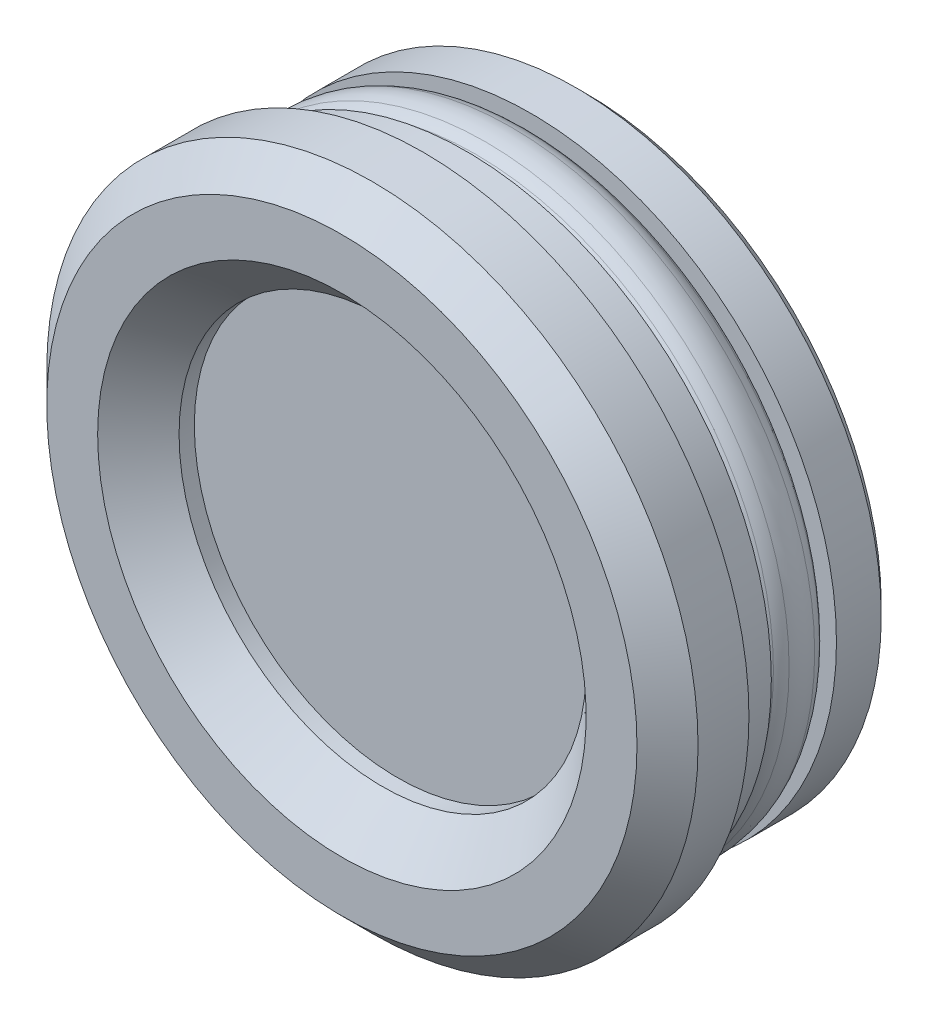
ISO-10303-21;
HEADER;
FILE_DESCRIPTION(('STEP AP214'),'2;1');
FILE_NAME('part.step','',(''),(''),'','','');
FILE_SCHEMA(('AUTOMOTIVE_DESIGN { 1 0 10303 214 1 1 1 1 }'));
ENDSEC;
DATA;
#1=APPLICATION_CONTEXT('core data for automotive mechanical design processes');
#2=APPLICATION_PROTOCOL_DEFINITION('international standard','automotive_design',2000,#1);
#3=PRODUCT_CONTEXT('',#1,'mechanical');
#4=PRODUCT('Part','Part','',(#3));
#5=PRODUCT_RELATED_PRODUCT_CATEGORY('part','',(#4));
#6=PRODUCT_DEFINITION_FORMATION('','',#4);
#7=PRODUCT_DEFINITION_CONTEXT('part definition',#1,'design');
#8=PRODUCT_DEFINITION('design','',#6,#7);
#9=PRODUCT_DEFINITION_SHAPE('','',#8);
#10=(LENGTH_UNIT() NAMED_UNIT(*) SI_UNIT(.MILLI.,.METRE.));
#11=(NAMED_UNIT(*) PLANE_ANGLE_UNIT() SI_UNIT($,.RADIAN.));
#12=(NAMED_UNIT(*) SI_UNIT($,.STERADIAN.) SOLID_ANGLE_UNIT());
#13=UNCERTAINTY_MEASURE_WITH_UNIT(LENGTH_MEASURE(1.E-05),#10,'distance_accuracy_value','');
#14=(GEOMETRIC_REPRESENTATION_CONTEXT(3) GLOBAL_UNCERTAINTY_ASSIGNED_CONTEXT((#13)) GLOBAL_UNIT_ASSIGNED_CONTEXT((#10,
#11,#12)) REPRESENTATION_CONTEXT('',''));
#15=CARTESIAN_POINT('',(0.,0.,0.));
#16=DIRECTION('',(0.,0.,1.));
#17=DIRECTION('',(1.,0.,0.));
#18=AXIS2_PLACEMENT_3D('',#15,#16,#17);
#19=CARTESIAN_POINT('',(0.,0.,-8.3));
#20=DIRECTION('',(0.,0.,-1.));
#21=DIRECTION('',(1.,0.,0.));
#22=AXIS2_PLACEMENT_3D('',#19,#20,#21);
#23=PLANE('',#22);
#24=CARTESIAN_POINT('',(0.,0.,-8.3));
#25=DIRECTION('',(0.,0.,-1.));
#26=DIRECTION('',(1.,0.,0.));
#27=AXIS2_PLACEMENT_3D('',#24,#25,#26);
#28=CIRCLE('',#27,13.5);
#29=CARTESIAN_POINT('',(13.5,0.,-8.3));
#30=VERTEX_POINT('',#29);
#31=EDGE_CURVE('E70',#30,#30,#28,.T.);
#32=ORIENTED_EDGE('',*,*,#31,.T.);
#33=EDGE_LOOP('',(#32));
#34=FACE_BOUND('',#33,.T.);
#35=ADVANCED_FACE('F12',(#34),#23,.T.);
#36=CARTESIAN_POINT('',(0.,0.,4.));
#37=DIRECTION('',(0.,0.,-1.));
#38=DIRECTION('',(1.,0.,0.));
#39=AXIS2_PLACEMENT_3D('',#36,#37,#38);
#40=PLANE('',#39);
#41=CARTESIAN_POINT('',(0.,0.,4.));
#42=DIRECTION('',(0.,0.,1.));
#43=DIRECTION('',(-1.,0.,0.));
#44=AXIS2_PLACEMENT_3D('',#41,#42,#43);
#45=CIRCLE('',#44,12.);
#46=CARTESIAN_POINT('',(-12.,0.,4.));
#47=VERTEX_POINT('',#46);
#48=EDGE_CURVE('E79',#47,#47,#45,.T.);
#49=ORIENTED_EDGE('',*,*,#48,.F.);
#50=EDGE_LOOP('',(#49));
#51=FACE_BOUND('',#50,.T.);
#52=CARTESIAN_POINT('',(0.,0.,4.));
#53=DIRECTION('',(0.,0.,-1.));
#54=DIRECTION('',(1.,0.,0.));
#55=AXIS2_PLACEMENT_3D('',#52,#53,#54);
#56=CIRCLE('',#55,14.5);
#57=CARTESIAN_POINT('',(14.5,0.,4.));
#58=VERTEX_POINT('',#57);
#59=EDGE_CURVE('E8',#58,#58,#56,.T.);
#60=ORIENTED_EDGE('',*,*,#59,.F.);
#61=EDGE_LOOP('',(#60));
#62=FACE_BOUND('',#61,.T.);
#63=ADVANCED_FACE('F85',(#51,#62),#40,.F.);
#64=CARTESIAN_POINT('',(0.,0.,4.));
#65=DIRECTION('',(0.,0.,-1.));
#66=DIRECTION('',(1.,0.,0.));
#67=AXIS2_PLACEMENT_3D('',#64,#65,#66);
#68=CONICAL_SURFACE('',#67,14.5,0.785398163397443);
#69=CARTESIAN_POINT('',(0.,0.,2.5));
#70=DIRECTION('',(0.,0.,-1.));
#71=DIRECTION('',(1.,0.,0.));
#72=AXIS2_PLACEMENT_3D('',#69,#70,#71);
#73=CIRCLE('',#72,16.);
#74=CARTESIAN_POINT('',(16.,0.,2.5));
#75=VERTEX_POINT('',#74);
#76=EDGE_CURVE('E18',#75,#75,#73,.T.);
#77=ORIENTED_EDGE('',*,*,#76,.F.);
#78=EDGE_LOOP('',(#77));
#79=FACE_BOUND('',#78,.T.);
#80=ORIENTED_EDGE('',*,*,#59,.T.);
#81=EDGE_LOOP('',(#80));
#82=FACE_BOUND('',#81,.T.);
#83=ADVANCED_FACE('F88',(#79,#82),#68,.T.);
#84=CARTESIAN_POINT('',(0.,0.,-14.0253012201));
#85=DIRECTION('',(0.,0.,-1.));
#86=DIRECTION('',(1.,0.,0.));
#87=AXIS2_PLACEMENT_3D('',#84,#85,#86);
#88=CYLINDRICAL_SURFACE('',#87,16.);
#89=CARTESIAN_POINT('',(0.,0.,0.));
#90=DIRECTION('',(0.,0.,-1.));
#91=DIRECTION('',(1.,0.,0.));
#92=AXIS2_PLACEMENT_3D('',#89,#90,#91);
#93=CIRCLE('',#92,16.);
#94=CARTESIAN_POINT('',(16.,0.,0.));
#95=VERTEX_POINT('',#94);
#96=EDGE_CURVE('E22',#95,#95,#93,.T.);
#97=ORIENTED_EDGE('',*,*,#96,.F.);
#98=EDGE_LOOP('',(#97));
#99=FACE_BOUND('',#98,.T.);
#100=ORIENTED_EDGE('',*,*,#76,.T.);
#101=EDGE_LOOP('',(#100));
#102=FACE_BOUND('',#101,.T.);
#103=ADVANCED_FACE('F95',(#99,#102),#88,.T.);
#104=CARTESIAN_POINT('',(0.,-15.,0.));
#105=DIRECTION('',(0.,0.,-1.));
#106=DIRECTION('',(1.,0.,0.));
#107=AXIS2_PLACEMENT_3D('',#104,#105,#106);
#108=PLANE('',#107);
#109=ORIENTED_EDGE('',*,*,#96,.T.);
#110=EDGE_LOOP('',(#109));
#111=FACE_BOUND('',#110,.T.);
#112=CARTESIAN_POINT('',(0.,0.,0.));
#113=DIRECTION('',(0.,0.,-1.));
#114=DIRECTION('',(1.,0.,0.));
#115=AXIS2_PLACEMENT_3D('',#112,#113,#114);
#116=CIRCLE('',#115,15.);
#117=CARTESIAN_POINT('',(15.,0.,0.));
#118=VERTEX_POINT('',#117);
#119=EDGE_CURVE('E26',#118,#118,#116,.T.);
#120=ORIENTED_EDGE('',*,*,#119,.F.);
#121=EDGE_LOOP('',(#120));
#122=FACE_BOUND('',#121,.T.);
#123=ADVANCED_FACE('F102',(#111,#122),#108,.T.);
#124=CARTESIAN_POINT('',(0.,0.,-14.0253012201));
#125=DIRECTION('',(0.,0.,-1.));
#126=DIRECTION('',(1.,0.,0.));
#127=AXIS2_PLACEMENT_3D('',#124,#125,#126);
#128=CYLINDRICAL_SURFACE('',#127,15.);
#129=ORIENTED_EDGE('',*,*,#119,.T.);
#130=EDGE_LOOP('',(#129));
#131=FACE_BOUND('',#130,.T.);
#132=CARTESIAN_POINT('',(0.,0.,-2.1));
#133=DIRECTION('',(0.,0.,-1.));
#134=DIRECTION('',(1.,0.,0.));
#135=AXIS2_PLACEMENT_3D('',#132,#133,#134);
#136=CIRCLE('',#135,15.);
#137=CARTESIAN_POINT('',(15.,0.,-2.1));
#138=VERTEX_POINT('',#137);
#139=EDGE_CURVE('E31',#138,#138,#136,.T.);
#140=ORIENTED_EDGE('',*,*,#139,.F.);
#141=EDGE_LOOP('',(#140));
#142=FACE_BOUND('',#141,.T.);
#143=ADVANCED_FACE('F106',(#131,#142),#128,.T.);
#144=CARTESIAN_POINT('',(0.,-13.75,-2.1));
#145=DIRECTION('',(0.,0.,-1.));
#146=DIRECTION('',(1.,0.,0.));
#147=AXIS2_PLACEMENT_3D('',#144,#145,#146);
#148=PLANE('',#147);
#149=ORIENTED_EDGE('',*,*,#139,.T.);
#150=EDGE_LOOP('',(#149));
#151=FACE_BOUND('',#150,.T.);
#152=CARTESIAN_POINT('',(0.,0.,-2.1));
#153=DIRECTION('',(0.,0.,-1.));
#154=DIRECTION('',(1.,0.,0.));
#155=AXIS2_PLACEMENT_3D('',#152,#153,#154);
#156=CIRCLE('',#155,13.75);
#157=CARTESIAN_POINT('',(13.75,0.,-2.1));
#158=VERTEX_POINT('',#157);
#159=EDGE_CURVE('E34',#158,#158,#156,.T.);
#160=ORIENTED_EDGE('',*,*,#159,.F.);
#161=EDGE_LOOP('',(#160));
#162=FACE_BOUND('',#161,.T.);
#163=ADVANCED_FACE('F110',(#151,#162),#148,.T.);
#164=CARTESIAN_POINT('',(0.,0.,-3.08575642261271));
#165=DIRECTION('',(0.,0.,-1.));
#166=DIRECTION('',(1.,0.,0.));
#167=AXIS2_PLACEMENT_3D('',#164,#165,#166);
#168=TOROIDAL_SURFACE('',#167,13.75,0.985756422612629);
#169=CARTESIAN_POINT('',(0.,0.,-2.2148384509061));
#170=DIRECTION('',(0.,0.,-1.));
#171=DIRECTION('',(1.,0.,0.));
#172=AXIS2_PLACEMENT_3D('',#169,#170,#171);
#173=CIRCLE('',#172,14.2117549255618);
#174=CARTESIAN_POINT('',(14.2117549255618,0.,-2.2148384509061));
#175=VERTEX_POINT('',#174);
#176=EDGE_CURVE('E37',#175,#175,#173,.T.);
#177=ORIENTED_EDGE('',*,*,#176,.F.);
#178=EDGE_LOOP('',(#177));
#179=FACE_BOUND('',#178,.T.);
#180=ORIENTED_EDGE('',*,*,#159,.T.);
#181=EDGE_LOOP('',(#180));
#182=FACE_BOUND('',#181,.T.);
#183=ADVANCED_FACE('F114',(#179,#182),#168,.T.);
#184=CARTESIAN_POINT('',(0.,0.,-3.3817801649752));
#185=DIRECTION('',(0.,0.,-1.));
#186=DIRECTION('',(1.,0.,0.));
#187=AXIS2_PLACEMENT_3D('',#184,#185,#186);
#188=TOROIDAL_SURFACE('',#187,13.5930501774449,1.32081358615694);
#189=CARTESIAN_POINT('',(0.,0.,-2.56862915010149));
#190=DIRECTION('',(0.,0.,-1.));
#191=DIRECTION('',(1.,0.,0.));
#192=AXIS2_PLACEMENT_3D('',#189,#190,#191);
#193=CIRCLE('',#192,14.6338834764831);
#194=CARTESIAN_POINT('',(14.6338834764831,0.,-2.56862915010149));
#195=VERTEX_POINT('',#194);
#196=EDGE_CURVE('E40',#195,#195,#193,.T.);
#197=ORIENTED_EDGE('',*,*,#196,.F.);
#198=EDGE_LOOP('',(#197));
#199=FACE_BOUND('',#198,.T.);
#200=ORIENTED_EDGE('',*,*,#176,.T.);
#201=EDGE_LOOP('',(#200));
#202=FACE_BOUND('',#201,.T.);
#203=ADVANCED_FACE('F118',(#199,#202),#188,.T.);
#204=CARTESIAN_POINT('',(0.,0.,-3.57438830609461));
#205=DIRECTION('',(0.,0.,-1.));
#206=DIRECTION('',(1.,0.,0.));
#207=AXIS2_PLACEMENT_3D('',#204,#205,#206);
#208=TOROIDAL_SURFACE('',#207,13.3465117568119,1.63366992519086);
#209=CARTESIAN_POINT('',(0.,0.,-3.07140613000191));
#210=DIRECTION('',(0.,0.,-1.));
#211=DIRECTION('',(1.,0.,0.));
#212=AXIS2_PLACEMENT_3D('',#209,#210,#211);
#213=CIRCLE('',#212,14.9008239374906);
#214=CARTESIAN_POINT('',(14.9008239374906,0.,-3.07140613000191));
#215=VERTEX_POINT('',#214);
#216=EDGE_CURVE('E43',#215,#215,#213,.T.);
#217=ORIENTED_EDGE('',*,*,#216,.F.);
#218=EDGE_LOOP('',(#217));
#219=FACE_BOUND('',#218,.T.);
#220=ORIENTED_EDGE('',*,*,#196,.T.);
#221=EDGE_LOOP('',(#220));
#222=FACE_BOUND('',#221,.T.);
#223=ADVANCED_FACE('F122',(#219,#222),#208,.T.);
#224=CARTESIAN_POINT('',(0.,0.,-3.7000000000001));
#225=DIRECTION('',(0.,0.,-1.));
#226=DIRECTION('',(1.,0.,0.));
#227=AXIS2_PLACEMENT_3D('',#224,#225,#226);
#228=TOROIDAL_SURFACE('',#227,12.958347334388,2.04165266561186);
#229=CARTESIAN_POINT('',(0.,0.,-4.32859386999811));
#230=DIRECTION('',(0.,0.,-1.));
#231=DIRECTION('',(1.,0.,0.));
#232=AXIS2_PLACEMENT_3D('',#229,#230,#231);
#233=CIRCLE('',#232,14.9008239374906);
#234=CARTESIAN_POINT('',(14.9008239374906,0.,-4.32859386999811));
#235=VERTEX_POINT('',#234);
#236=EDGE_CURVE('E46',#235,#235,#233,.T.);
#237=ORIENTED_EDGE('',*,*,#236,.F.);
#238=EDGE_LOOP('',(#237));
#239=FACE_BOUND('',#238,.T.);
#240=ORIENTED_EDGE('',*,*,#216,.T.);
#241=EDGE_LOOP('',(#240));
#242=FACE_BOUND('',#241,.T.);
#243=ADVANCED_FACE('F126',(#239,#242),#228,.T.);
#244=CARTESIAN_POINT('',(0.,0.,-3.82561169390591));
#245=DIRECTION('',(0.,0.,-1.));
#246=DIRECTION('',(1.,0.,0.));
#247=AXIS2_PLACEMENT_3D('',#244,#245,#246);
#248=TOROIDAL_SURFACE('',#247,13.3465117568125,1.63366992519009);
#249=CARTESIAN_POINT('',(0.,0.,-4.8313708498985));
#250=DIRECTION('',(0.,0.,-1.));
#251=DIRECTION('',(1.,0.,0.));
#252=AXIS2_PLACEMENT_3D('',#249,#250,#251);
#253=CIRCLE('',#252,14.6338834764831);
#254=CARTESIAN_POINT('',(14.6338834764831,0.,-4.8313708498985));
#255=VERTEX_POINT('',#254);
#256=EDGE_CURVE('E49',#255,#255,#253,.T.);
#257=ORIENTED_EDGE('',*,*,#256,.F.);
#258=EDGE_LOOP('',(#257));
#259=FACE_BOUND('',#258,.T.);
#260=ORIENTED_EDGE('',*,*,#236,.T.);
#261=EDGE_LOOP('',(#260));
#262=FACE_BOUND('',#261,.T.);
#263=ADVANCED_FACE('F130',(#259,#262),#248,.T.);
#264=CARTESIAN_POINT('',(0.,0.,-4.01821983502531));
#265=DIRECTION('',(0.,0.,-1.));
#266=DIRECTION('',(1.,0.,0.));
#267=AXIS2_PLACEMENT_3D('',#264,#265,#266);
#268=TOROIDAL_SURFACE('',#267,13.5930501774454,1.32081358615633);
#269=CARTESIAN_POINT('',(0.,0.,-5.1851615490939));
#270=DIRECTION('',(0.,0.,-1.));
#271=DIRECTION('',(1.,0.,0.));
#272=AXIS2_PLACEMENT_3D('',#269,#270,#271);
#273=CIRCLE('',#272,14.2117549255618);
#274=CARTESIAN_POINT('',(14.2117549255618,0.,-5.1851615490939));
#275=VERTEX_POINT('',#274);
#276=EDGE_CURVE('E52',#275,#275,#273,.T.);
#277=ORIENTED_EDGE('',*,*,#276,.F.);
#278=EDGE_LOOP('',(#277));
#279=FACE_BOUND('',#278,.T.);
#280=ORIENTED_EDGE('',*,*,#256,.T.);
#281=EDGE_LOOP('',(#280));
#282=FACE_BOUND('',#281,.T.);
#283=ADVANCED_FACE('F134',(#279,#282),#268,.T.);
#284=CARTESIAN_POINT('',(0.,0.,-4.3142435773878));
#285=DIRECTION('',(0.,0.,-1.));
#286=DIRECTION('',(1.,0.,0.));
#287=AXIS2_PLACEMENT_3D('',#284,#285,#286);
#288=TOROIDAL_SURFACE('',#287,13.75,0.985756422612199);
#289=CARTESIAN_POINT('',(0.,0.,-5.3));
#290=DIRECTION('',(0.,0.,-1.));
#291=DIRECTION('',(1.,0.,0.));
#292=AXIS2_PLACEMENT_3D('',#289,#290,#291);
#293=CIRCLE('',#292,13.75);
#294=CARTESIAN_POINT('',(13.75,0.,-5.3));
#295=VERTEX_POINT('',#294);
#296=EDGE_CURVE('E55',#295,#295,#293,.T.);
#297=ORIENTED_EDGE('',*,*,#296,.F.);
#298=EDGE_LOOP('',(#297));
#299=FACE_BOUND('',#298,.T.);
#300=ORIENTED_EDGE('',*,*,#276,.T.);
#301=EDGE_LOOP('',(#300));
#302=FACE_BOUND('',#301,.T.);
#303=ADVANCED_FACE('F138',(#299,#302),#288,.T.);
#304=CARTESIAN_POINT('',(0.,-13.75,-5.3));
#305=DIRECTION('',(0.,0.,-1.));
#306=DIRECTION('',(1.,0.,0.));
#307=AXIS2_PLACEMENT_3D('',#304,#305,#306);
#308=PLANE('',#307);
#309=CARTESIAN_POINT('',(0.,0.,-5.3));
#310=DIRECTION('',(0.,0.,-1.));
#311=DIRECTION('',(1.,0.,0.));
#312=AXIS2_PLACEMENT_3D('',#309,#310,#311);
#313=CIRCLE('',#312,15.);
#314=CARTESIAN_POINT('',(15.,0.,-5.3));
#315=VERTEX_POINT('',#314);
#316=EDGE_CURVE('E58',#315,#315,#313,.T.);
#317=ORIENTED_EDGE('',*,*,#316,.F.);
#318=EDGE_LOOP('',(#317));
#319=FACE_BOUND('',#318,.T.);
#320=ORIENTED_EDGE('',*,*,#296,.T.);
#321=EDGE_LOOP('',(#320));
#322=FACE_BOUND('',#321,.T.);
#323=ADVANCED_FACE('F142',(#319,#322),#308,.F.);
#324=CARTESIAN_POINT('',(0.,0.,-14.0253012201));
#325=DIRECTION('',(0.,0.,-1.));
#326=DIRECTION('',(1.,0.,0.));
#327=AXIS2_PLACEMENT_3D('',#324,#325,#326);
#328=CYLINDRICAL_SURFACE('',#327,15.);
#329=ORIENTED_EDGE('',*,*,#316,.T.);
#330=EDGE_LOOP('',(#329));
#331=FACE_BOUND('',#330,.T.);
#332=CARTESIAN_POINT('',(0.,0.,-7.5));
#333=DIRECTION('',(0.,0.,-1.));
#334=DIRECTION('',(1.,0.,0.));
#335=AXIS2_PLACEMENT_3D('',#332,#333,#334);
#336=CIRCLE('',#335,15.);
#337=CARTESIAN_POINT('',(15.,0.,-7.5));
#338=VERTEX_POINT('',#337);
#339=EDGE_CURVE('E61',#338,#338,#336,.T.);
#340=ORIENTED_EDGE('',*,*,#339,.F.);
#341=EDGE_LOOP('',(#340));
#342=FACE_BOUND('',#341,.T.);
#343=ADVANCED_FACE('F146',(#331,#342),#328,.T.);
#344=CARTESIAN_POINT('',(0.,0.,-8.));
#345=DIRECTION('',(0.,0.,1.));
#346=DIRECTION('',(-1.,0.,0.));
#347=AXIS2_PLACEMENT_3D('',#344,#345,#346);
#348=CONICAL_SURFACE('',#347,14.5,0.785398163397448);
#349=ORIENTED_EDGE('',*,*,#339,.T.);
#350=EDGE_LOOP('',(#349));
#351=FACE_BOUND('',#350,.T.);
#352=CARTESIAN_POINT('',(0.,0.,-8.));
#353=DIRECTION('',(0.,0.,-1.));
#354=DIRECTION('',(1.,0.,0.));
#355=AXIS2_PLACEMENT_3D('',#352,#353,#354);
#356=CIRCLE('',#355,14.5);
#357=CARTESIAN_POINT('',(14.5,0.,-8.));
#358=VERTEX_POINT('',#357);
#359=EDGE_CURVE('E64',#358,#358,#356,.T.);
#360=ORIENTED_EDGE('',*,*,#359,.F.);
#361=EDGE_LOOP('',(#360));
#362=FACE_BOUND('',#361,.T.);
#363=ADVANCED_FACE('F150',(#351,#362),#348,.T.);
#364=CARTESIAN_POINT('',(0.,-13.5,-8.));
#365=DIRECTION('',(0.,0.,-1.));
#366=DIRECTION('',(1.,0.,0.));
#367=AXIS2_PLACEMENT_3D('',#364,#365,#366);
#368=PLANE('',#367);
#369=ORIENTED_EDGE('',*,*,#359,.T.);
#370=EDGE_LOOP('',(#369));
#371=FACE_BOUND('',#370,.T.);
#372=CARTESIAN_POINT('',(0.,0.,-8.));
#373=DIRECTION('',(0.,0.,-1.));
#374=DIRECTION('',(1.,0.,0.));
#375=AXIS2_PLACEMENT_3D('',#372,#373,#374);
#376=CIRCLE('',#375,13.5);
#377=CARTESIAN_POINT('',(13.5,0.,-8.));
#378=VERTEX_POINT('',#377);
#379=EDGE_CURVE('E67',#378,#378,#376,.T.);
#380=ORIENTED_EDGE('',*,*,#379,.F.);
#381=EDGE_LOOP('',(#380));
#382=FACE_BOUND('',#381,.T.);
#383=ADVANCED_FACE('F154',(#371,#382),#368,.T.);
#384=CARTESIAN_POINT('',(0.,0.,-14.0253012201));
#385=DIRECTION('',(0.,0.,-1.));
#386=DIRECTION('',(1.,0.,0.));
#387=AXIS2_PLACEMENT_3D('',#384,#385,#386);
#388=CYLINDRICAL_SURFACE('',#387,13.5);
#389=ORIENTED_EDGE('',*,*,#379,.T.);
#390=EDGE_LOOP('',(#389));
#391=FACE_BOUND('',#390,.T.);
#392=ORIENTED_EDGE('',*,*,#31,.F.);
#393=EDGE_LOOP('',(#392));
#394=FACE_BOUND('',#393,.T.);
#395=ADVANCED_FACE('F158',(#391,#394),#388,.T.);
#396=CARTESIAN_POINT('',(0.,0.,4.));
#397=DIRECTION('',(0.,0.,1.));
#398=DIRECTION('',(-1.,0.,0.));
#399=AXIS2_PLACEMENT_3D('',#396,#397,#398);
#400=CONICAL_SURFACE('',#399,12.,0.785398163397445);
#401=CARTESIAN_POINT('',(0.,0.,2.));
#402=DIRECTION('',(0.,0.,1.));
#403=DIRECTION('',(-1.,0.,0.));
#404=AXIS2_PLACEMENT_3D('',#401,#402,#403);
#405=CIRCLE('',#404,10.);
#406=CARTESIAN_POINT('',(-10.,0.,2.));
#407=VERTEX_POINT('',#406);
#408=EDGE_CURVE('E73',#407,#407,#405,.T.);
#409=ORIENTED_EDGE('',*,*,#408,.F.);
#410=EDGE_LOOP('',(#409));
#411=FACE_BOUND('',#410,.T.);
#412=ORIENTED_EDGE('',*,*,#48,.T.);
#413=EDGE_LOOP('',(#412));
#414=FACE_BOUND('',#413,.T.);
#415=ADVANCED_FACE('F83',(#411,#414),#400,.F.);
#416=CARTESIAN_POINT('',(0.,0.,5.4394782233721));
#417=DIRECTION('',(0.,0.,1.));
#418=DIRECTION('',(-1.,0.,0.));
#419=AXIS2_PLACEMENT_3D('',#416,#417,#418);
#420=CYLINDRICAL_SURFACE('',#419,10.);
#421=CARTESIAN_POINT('',(0.,0.,1.25));
#422=DIRECTION('',(0.,0.,1.));
#423=DIRECTION('',(-1.,0.,0.));
#424=AXIS2_PLACEMENT_3D('',#421,#422,#423);
#425=CIRCLE('',#424,10.);
#426=CARTESIAN_POINT('',(-10.,0.,1.25));
#427=VERTEX_POINT('',#426);
#428=EDGE_CURVE('E76',#427,#427,#425,.T.);
#429=ORIENTED_EDGE('',*,*,#428,.F.);
#430=EDGE_LOOP('',(#429));
#431=FACE_BOUND('',#430,.T.);
#432=ORIENTED_EDGE('',*,*,#408,.T.);
#433=EDGE_LOOP('',(#432));
#434=FACE_BOUND('',#433,.T.);
#435=ADVANCED_FACE('F165',(#431,#434),#420,.F.);
#436=CARTESIAN_POINT('',(0.,-10.,1.25));
#437=DIRECTION('',(0.,0.,-1.));
#438=DIRECTION('',(1.,0.,0.));
#439=AXIS2_PLACEMENT_3D('',#436,#437,#438);
#440=PLANE('',#439);
#441=ORIENTED_EDGE('',*,*,#428,.T.);
#442=EDGE_LOOP('',(#441));
#443=FACE_BOUND('',#442,.T.);
#444=ADVANCED_FACE('F169',(#443),#440,.F.);
#445=CLOSED_SHELL('',(#35,#63,#83,#103,#123,#143,#163,#183,#203,#223,#243,#263,#283,#303,#323,
#343,#363,#383,#395,#415,#435,#444));
#446=MANIFOLD_SOLID_BREP('B1',#445);
#447=ADVANCED_BREP_SHAPE_REPRESENTATION('',(#18,#446),#14);
#448=SHAPE_DEFINITION_REPRESENTATION(#9,#447);
ENDSEC;
END-ISO-10303-21;
